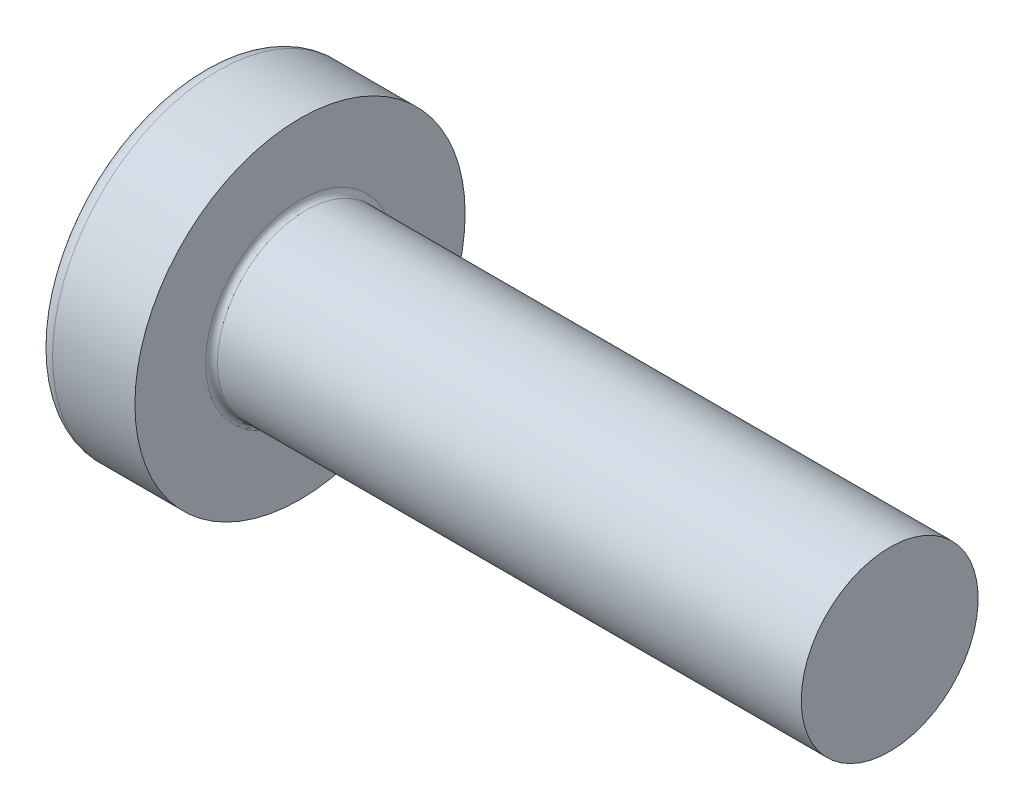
from build123d import *

# Parameters (mm, degrees)
FILLET1_R    = 0.1
RECPAT_COUNT = 2
RECPAT_ANGLE = 90


with BuildPart() as part:
    # BodySke → Base-Revolve (revolve)
    with BuildSketch(Plane.XY, mode=Mode.PRIVATE) as base_revolve_sk:
        with BuildLine():
            Line((2.4, 1.5), (2.4, 2.8))
            Line((2.4, 2.8), (1.003501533, 2.8))
            ThreePointArc((1.003501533, 2.8), (0.873295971, 2.76653015), (0.775371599, 2.674418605))
            ThreePointArc((0.775371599, 2.674418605), (0.197753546, 1.392274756), (0, 0))
            Line((0, 0), (12.4, 0))
            Line((12.4, 0), (12.4, 1.5))
            Line((12.4, 1.5), (2.4, 1.5))
        make_face()
    revolve(base_revolve_sk.sketch.rotate(Axis((1.003501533, 0, 0), (1, 0, 0)), 90), axis=Axis((1.003501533, 0, 0), (1, 0, 0)))

    # Fillet1
    fillet1_edges = [part.edges().sort_by_distance(p)[0] for p in [
        (2.4, 0, -1.5),
    ]]
    fillet(fillet1_edges, radius=FILLET1_R)

    # Sketch3 → Recess section 0
    with BuildSketch(Plane(origin=(0, 0, 0), x_dir=(0, 0, -1), z_dir=(1, 0, 0))):
        with BuildLine():
            Line((0.37, -1.4), (-0.37, -1.4))
            Line((-0.37, -1.4), (-0.37, 1.4))
            Line((-0.37, 1.4), (0.37, 1.4))
            Line((0.37, 1.4), (0.37, -1.4))
        make_face()
    # Sketch4 → Recess section 1
    with BuildSketch(Plane(origin=(1.75, 0, 0), x_dir=(0, 0, -1), z_dir=(1, 0, 0))):
        with BuildLine():
            Line((0.37, -0.527482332), (-0.37, -0.527482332))
            Line((-0.37, -0.527482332), (-0.37, 0.527482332))
            Line((-0.37, 0.527482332), (0.37, 0.527482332))
            Line((0.37, 0.527482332), (0.37, -0.527482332))
        make_face()
    recess = loft(mode=Mode.SUBTRACT)

    # RecPat: Recess ×2 about axis
    recpat_axis = Axis((0, 0, 0), (1, 0, 0))
    for i in range(1, RECPAT_COUNT):
        add(recess.rotate(recpat_axis, i * RECPAT_ANGLE / (RECPAT_COUNT - 1)), mode=Mode.SUBTRACT)

    # RecCorSke → RecessCore (revolve, cut)
    with BuildSketch(Plane.XY, mode=Mode.PRIVATE) as recesscore_sk:
        Polygon((0, 0), (0, 0.678371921), (1.75, 0.556), (1.930655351, 0), align=None)
    revolve(recesscore_sk.sketch.rotate(Axis((-3.175, 0, 0), (1, 0, 0)), 344.185974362), axis=Axis((-3.175, 0, 0), (1, 0, 0)), mode=Mode.SUBTRACT)


solid = part.part
